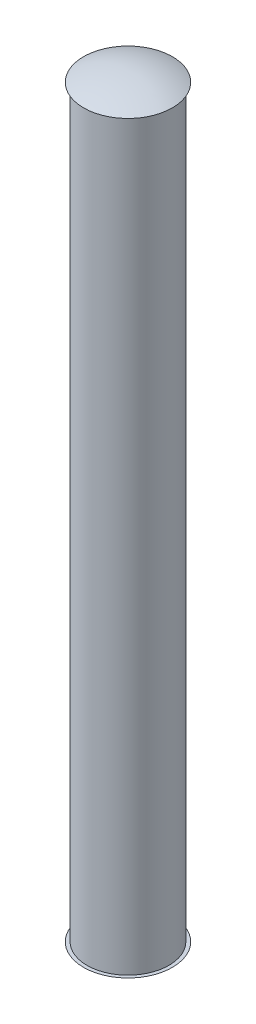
from build123d import *


with BuildPart() as part:
    # Sketch1 → Base-Revolve (revolve)
    with BuildSketch(Plane.XY, mode=Mode.PRIVATE) as base_revolve_sk:
        with BuildLine():
            Line((4.54369013, 1.016), (4.191, 1.016))
            Line((4.191, 1.016), (4.191, 77.216))
            Line((4.191, 77.216), (4.54369013, 77.216))
            ThreePointArc((4.54369013, 77.216), (2.327948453, 77.974901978), (0, 78.232))
            Line((0, 78.232), (0, 0))
            ThreePointArc((0, 0), (2.328641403, 0.253999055), (4.54369013, 1.016))
        make_face()
    revolve(base_revolve_sk.sketch.rotate(Axis((0, 74.134337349, 0), (0, -1, 0)), 90), axis=Axis((0, 74.134337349, 0), (0, -1, 0)))


solid = part.part
